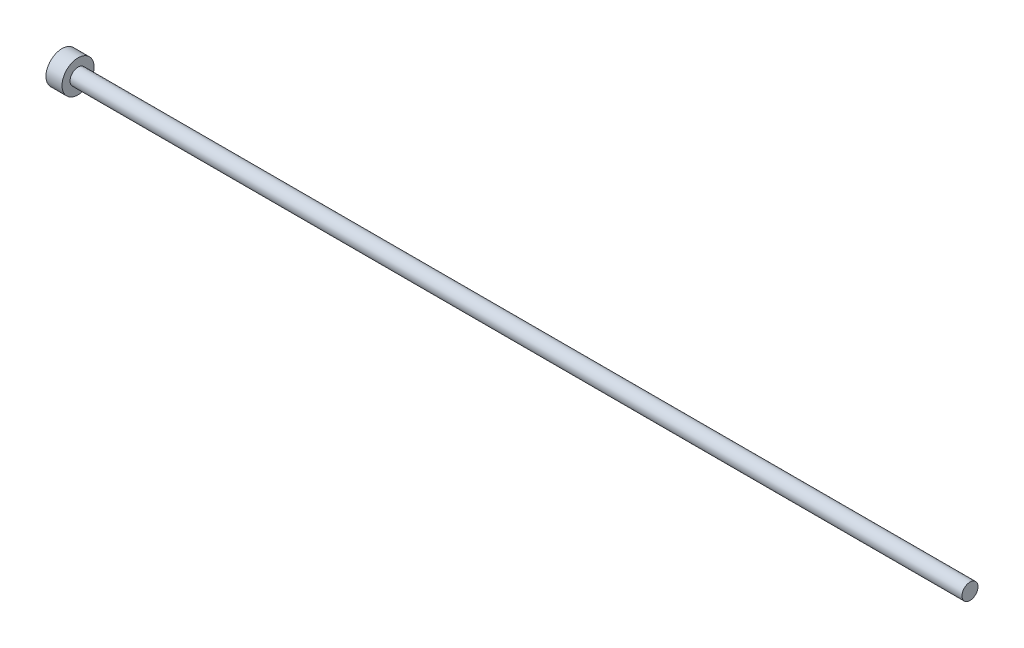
ISO-10303-21;
HEADER;
FILE_DESCRIPTION(('STEP AP214'),'2;1');
FILE_NAME('part.step','',(''),(''),'','','');
FILE_SCHEMA(('AUTOMOTIVE_DESIGN { 1 0 10303 214 1 1 1 1 }'));
ENDSEC;
DATA;
#1=APPLICATION_CONTEXT('core data for automotive mechanical design processes');
#2=APPLICATION_PROTOCOL_DEFINITION('international standard','automotive_design',2000,#1);
#3=PRODUCT_CONTEXT('',#1,'mechanical');
#4=PRODUCT('Part','Part','',(#3));
#5=PRODUCT_RELATED_PRODUCT_CATEGORY('part','',(#4));
#6=PRODUCT_DEFINITION_FORMATION('','',#4);
#7=PRODUCT_DEFINITION_CONTEXT('part definition',#1,'design');
#8=PRODUCT_DEFINITION('design','',#6,#7);
#9=PRODUCT_DEFINITION_SHAPE('','',#8);
#10=(LENGTH_UNIT() NAMED_UNIT(*) SI_UNIT(.MILLI.,.METRE.));
#11=(NAMED_UNIT(*) PLANE_ANGLE_UNIT() SI_UNIT($,.RADIAN.));
#12=(NAMED_UNIT(*) SI_UNIT($,.STERADIAN.) SOLID_ANGLE_UNIT());
#13=UNCERTAINTY_MEASURE_WITH_UNIT(LENGTH_MEASURE(1.E-05),#10,'distance_accuracy_value','');
#14=(GEOMETRIC_REPRESENTATION_CONTEXT(3) GLOBAL_UNCERTAINTY_ASSIGNED_CONTEXT((#13)) GLOBAL_UNIT_ASSIGNED_CONTEXT((#10,
#11,#12)) REPRESENTATION_CONTEXT('',''));
#15=CARTESIAN_POINT('',(0.,0.,0.));
#16=DIRECTION('',(0.,0.,1.));
#17=DIRECTION('',(1.,0.,0.));
#18=AXIS2_PLACEMENT_3D('',#15,#16,#17);
#19=CARTESIAN_POINT('',(0.,1.,0.));
#20=DIRECTION('',(-1.,0.,0.));
#21=DIRECTION('',(0.,0.,1.));
#22=AXIS2_PLACEMENT_3D('',#19,#20,#21);
#23=PLANE('',#22);
#24=CARTESIAN_POINT('',(0.,0.,0.));
#25=DIRECTION('',(1.,0.,0.));
#26=DIRECTION('',(0.,0.,-1.));
#27=AXIS2_PLACEMENT_3D('',#24,#25,#26);
#28=CIRCLE('',#27,2.);
#29=CARTESIAN_POINT('',(0.,0.,-2.));
#30=VERTEX_POINT('',#29);
#31=EDGE_CURVE('E18',#30,#30,#28,.T.);
#32=ORIENTED_EDGE('',*,*,#31,.F.);
#33=EDGE_LOOP('',(#32));
#34=FACE_BOUND('',#33,.T.);
#35=ADVANCED_FACE('F15',(#34),#23,.T.);
#36=CARTESIAN_POINT('',(1.,0.,0.));
#37=DIRECTION('',(1.,0.,0.));
#38=DIRECTION('',(0.,0.,-1.));
#39=AXIS2_PLACEMENT_3D('',#36,#37,#38);
#40=CYLINDRICAL_SURFACE('',#39,2.);
#41=ORIENTED_EDGE('',*,*,#31,.T.);
#42=EDGE_LOOP('',(#41));
#43=FACE_BOUND('',#42,.T.);
#44=CARTESIAN_POINT('',(2.,0.,0.));
#45=DIRECTION('',(1.,0.,0.));
#46=DIRECTION('',(0.,0.,-1.));
#47=AXIS2_PLACEMENT_3D('',#44,#45,#46);
#48=CIRCLE('',#47,2.);
#49=CARTESIAN_POINT('',(2.,0.,-2.));
#50=VERTEX_POINT('',#49);
#51=EDGE_CURVE('E27',#50,#50,#48,.T.);
#52=ORIENTED_EDGE('',*,*,#51,.F.);
#53=EDGE_LOOP('',(#52));
#54=FACE_BOUND('',#53,.T.);
#55=ADVANCED_FACE('F35',(#43,#54),#40,.T.);
#56=CARTESIAN_POINT('',(113.2,0.500000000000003,0.));
#57=DIRECTION('',(1.,0.,0.));
#58=DIRECTION('',(0.,0.,-1.));
#59=AXIS2_PLACEMENT_3D('',#56,#57,#58);
#60=PLANE('',#59);
#61=CARTESIAN_POINT('',(113.2,0.,0.));
#62=DIRECTION('',(1.,0.,0.));
#63=DIRECTION('',(0.,0.,-1.));
#64=AXIS2_PLACEMENT_3D('',#61,#62,#63);
#65=CIRCLE('',#64,1.);
#66=CARTESIAN_POINT('',(113.2,0.,-1.));
#67=VERTEX_POINT('',#66);
#68=EDGE_CURVE('E22',#67,#67,#65,.F.);
#69=ORIENTED_EDGE('',*,*,#68,.F.);
#70=EDGE_LOOP('',(#69));
#71=FACE_BOUND('',#70,.T.);
#72=ADVANCED_FACE('F43',(#71),#60,.T.);
#73=CARTESIAN_POINT('',(2.,1.5,0.));
#74=DIRECTION('',(1.,0.,0.));
#75=DIRECTION('',(0.,0.,-1.));
#76=AXIS2_PLACEMENT_3D('',#73,#74,#75);
#77=PLANE('',#76);
#78=CARTESIAN_POINT('',(2.,0.,0.));
#79=DIRECTION('',(1.,0.,0.));
#80=DIRECTION('',(0.,0.,-1.));
#81=AXIS2_PLACEMENT_3D('',#78,#79,#80);
#82=CIRCLE('',#81,1.);
#83=CARTESIAN_POINT('',(2.,0.,-1.));
#84=VERTEX_POINT('',#83);
#85=EDGE_CURVE('E10',#84,#84,#82,.T.);
#86=ORIENTED_EDGE('',*,*,#85,.F.);
#87=EDGE_LOOP('',(#86));
#88=FACE_BOUND('',#87,.T.);
#89=ORIENTED_EDGE('',*,*,#51,.T.);
#90=EDGE_LOOP('',(#89));
#91=FACE_BOUND('',#90,.T.);
#92=ADVANCED_FACE('F46',(#88,#91),#77,.T.);
#93=CARTESIAN_POINT('',(57.5999999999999,0.,0.));
#94=DIRECTION('',(1.,0.,0.));
#95=DIRECTION('',(0.,0.,-1.));
#96=AXIS2_PLACEMENT_3D('',#93,#94,#95);
#97=CYLINDRICAL_SURFACE('',#96,1.);
#98=ORIENTED_EDGE('',*,*,#85,.T.);
#99=EDGE_LOOP('',(#98));
#100=FACE_BOUND('',#99,.T.);
#101=ORIENTED_EDGE('',*,*,#68,.T.);
#102=EDGE_LOOP('',(#101));
#103=FACE_BOUND('',#102,.T.);
#104=ADVANCED_FACE('F44',(#100,#103),#97,.T.);
#105=CLOSED_SHELL('',(#35,#55,#72,#92,#104));
#106=MANIFOLD_SOLID_BREP('B1',#105);
#107=ADVANCED_BREP_SHAPE_REPRESENTATION('',(#18,#106),#14);
#108=SHAPE_DEFINITION_REPRESENTATION(#9,#107);
ENDSEC;
END-ISO-10303-21;
